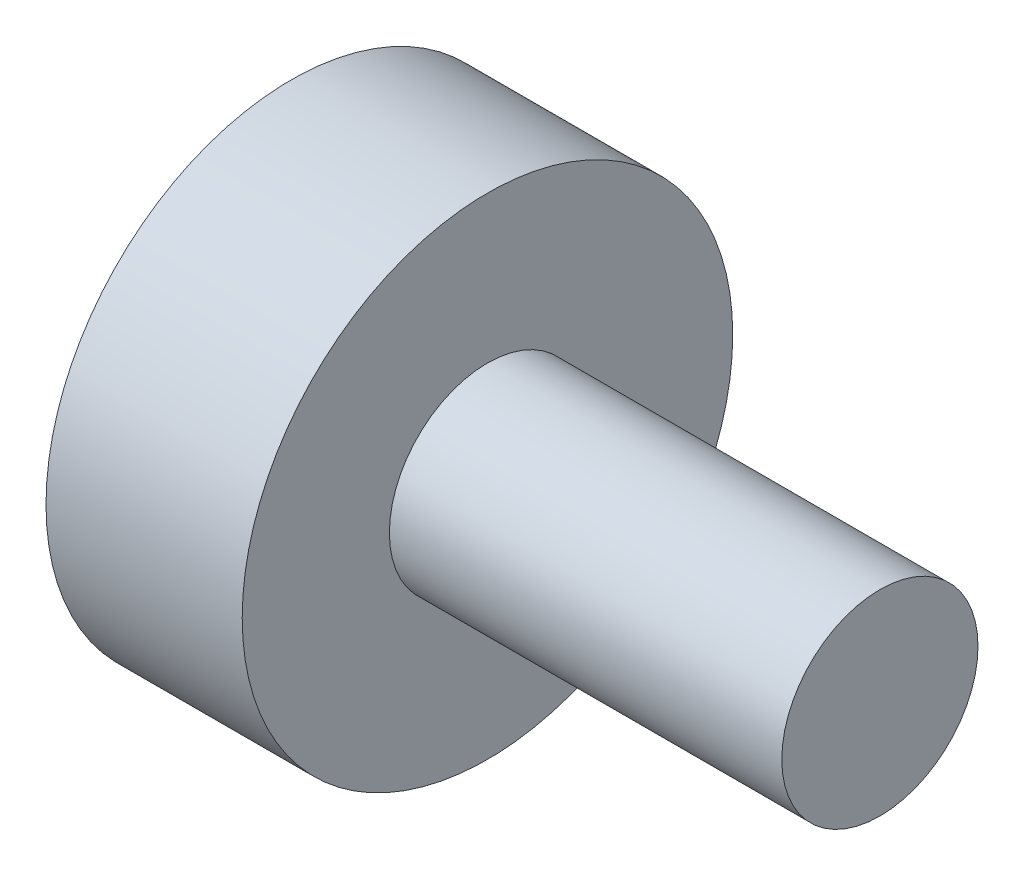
from build123d import *


with BuildPart() as part:
    # Esquisse1 → R_volution1 (revolve)
    with BuildSketch(Plane.XY, mode=Mode.PRIVATE) as r_volution1_sk:
        Polygon((0, 0), (0, 25), (20, 25), (20, 10), (60, 10), (60, 0), align=None)
    revolve(r_volution1_sk.sketch.rotate(Axis((-9.428731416, 0, 0), (1, 0, 0)), 90), axis=Axis((-9.428731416, 0, 0), (1, 0, 0)))


solid = part.part
